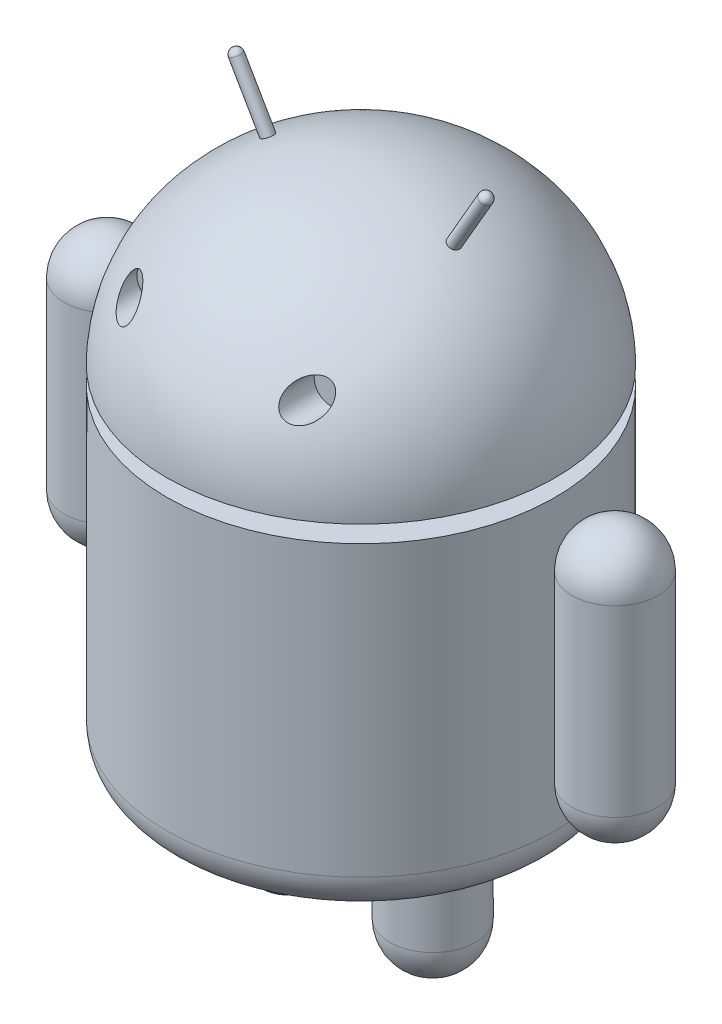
from build123d import *

# Parameters (mm, degrees)
SKETCH3_R      = 10.922
EXTRUDE1_DEPTH = 35.56
FILLET1_R      = 10.922
SKETCH5_R      = 4.064
EXTRUDE2_DEPTH = 19.05


with BuildPart() as part:
    # Sketch2 → Revolve1 (revolve)
    with BuildSketch(Plane(origin=(0, 0, 0), x_dir=(0, 0, -1), z_dir=(1, 0, 0))):
        with BuildLine():
            Line((0, 0), (-39.37, 0))
            ThreePointArc((-39.37, 0), (-46.554204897, 2.975795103), (-49.53, 10.16))
            Line((-49.53, 10.16), (-49.53, 83.82))
            Line((-49.53, 83.82), (0, 83.82))
            Line((0, 83.82), (0, 0))
        make_face()
        with BuildLine():
            Line((-49.53, 88.138), (0, 88.138))
            Line((0, 88.138), (0, 132.588))
            add(Edge.make_bspline(
                [(0, 132.588), (-49.53, 132.588), (-49.53, 88.138)],
                knots=[4.71238898, 4.71238898, 4.71238898, 6.283185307, 6.283185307, 6.283185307], degree=2, weights=[1, 0.707106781, 1]))
        make_face()
    revolve(axis=Axis((0, 83.82, 0), (0, -1, 0)))

    # Sketch3 → Extrude1 (add)
    with BuildSketch(Plane.XZ):
        with Locations(Location((-18.288, 0, 0), (0, 0, 270))):
            Circle(SKETCH3_R)
        with Locations(Location((18.288, 0, 0), (0, 0, 270))):
            Circle(SKETCH3_R)
    extrude(amount=EXTRUDE1_DEPTH)

    # Fillet1
    fillet1_edges = [part.edges().sort_by_distance(p)[0] for p in [
        (-18.288, -35.56, 10.922),
        (18.288, -35.56, 10.922),
    ]]
    fillet(fillet1_edges, radius=FILLET1_R)

    # Sketch5 → Extrude2 (cut)
    with BuildSketch(Plane.XY.offset(49.53)):
        with Locations((-22.606, 109.982)):
            Circle(SKETCH5_R)
        with Locations((22.606, 109.982)):
            Circle(SKETCH5_R)
    extrude(amount=-EXTRUDE2_DEPTH, mode=Mode.SUBTRACT)

    # Sketch7 → Revolve3 (revolve)
    with BuildSketch(Plane.XY, mode=Mode.PRIVATE) as revolve3_sk:
        with BuildLine():
            Line((-33.102338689, 140.225227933), (-23.831338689, 124.167384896))
            Line((-23.831338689, 124.167384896), (-22.511515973, 124.929384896))
            Line((-22.511515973, 124.929384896), (-32.544515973, 142.307050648))
            ThreePointArc((-32.544515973, 142.307050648), (-33.254586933, 141.381668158), (-33.102338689, 140.225227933))
        make_face()
    revolve3 = revolve(revolve3_sk.sketch.rotate(Axis((-22.511515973, 124.929384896, 0), (-0.4999999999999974, 0.8660254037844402, 0)), 180), axis=Axis((-22.511515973, 124.929384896, 0), (-0.4999999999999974, 0.8660254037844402, 0)))

    # Mirror6: Revolve3 across plane
    add(revolve3.mirror(Plane(origin=(0, 0, 0), x_dir=(0, 0, 1), z_dir=(1, 0, 0))))


with BuildPart() as body_2:
    # Sketch6 → Revolve2 (revolve)
    with BuildSketch(Plane.XY):
        with BuildLine():
            Line((-53.848, 75.184), (-53.848, 28.448))
            ThreePointArc((-53.848, 28.448), (-57.046979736, 20.724979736), (-64.77, 17.526))
            Line((-64.77, 17.526), (-64.77, 86.106))
            ThreePointArc((-64.77, 86.106), (-57.046979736, 82.907020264), (-53.848, 75.184))
        make_face()
    revolve(axis=Axis((-64.77, 86.106, 0), (0, -1, 0)))


with BuildPart() as body_3:
    # Mirror5: mirrored copy
    add(body_2.part.mirror(Plane(origin=(0, 0, 0), x_dir=(0, 0, 1), z_dir=(1, 0, 0))))


solid = Compound([part.part, body_2.part, body_3.part])
